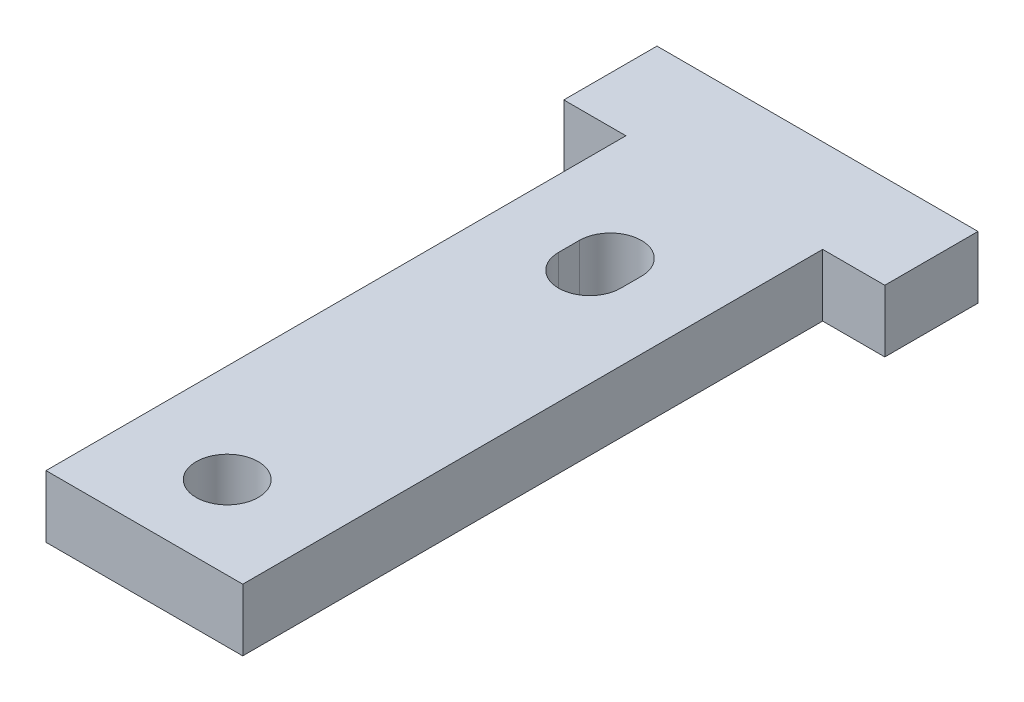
from build123d import *

# Parameters (mm, degrees)
SKETCH1_R           = 1.5
BOSS_EXTRUDE1_DEPTH = 3


with BuildPart() as part:
    # Sketch1 → Boss-Extrude1 (new body)
    with BuildSketch(Plane(origin=(0, 0, 0), x_dir=(1, 0, 0), z_dir=(0, 1, 0))):
        Polygon((-7.75, -0.706755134), (7.75, -0.706755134), (7.75, -5.206755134), (4.75, -5.206755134), (4.75, -33.206755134), (-4.75, -33.206755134), (-4.75, -5.206755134), (-7.75, -5.206755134), align=None)
        with Locations(Location((0, -29.206755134, 0), (0, 0, 270))):
            Circle(SKETCH1_R, mode=Mode.SUBTRACT)
        with BuildLine():
            Line((1.5, -11.264845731), (1.5, -10.706755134))
            ThreePointArc((1.5, -10.706755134), (0, -9.206755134), (-1.5, -10.706755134))
            Line((-1.5, -10.706755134), (-1.5, -11.264845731))
            Line((-1.5, -11.264845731), (-1.5, -11.706755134))
            ThreePointArc((-1.5, -11.706755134), (0, -13.206755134), (1.5, -11.706755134))
            Line((1.5, -11.706755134), (1.5, -11.264845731))
        make_face(mode=Mode.SUBTRACT)
    extrude(amount=BOSS_EXTRUDE1_DEPTH)


solid = part.part
